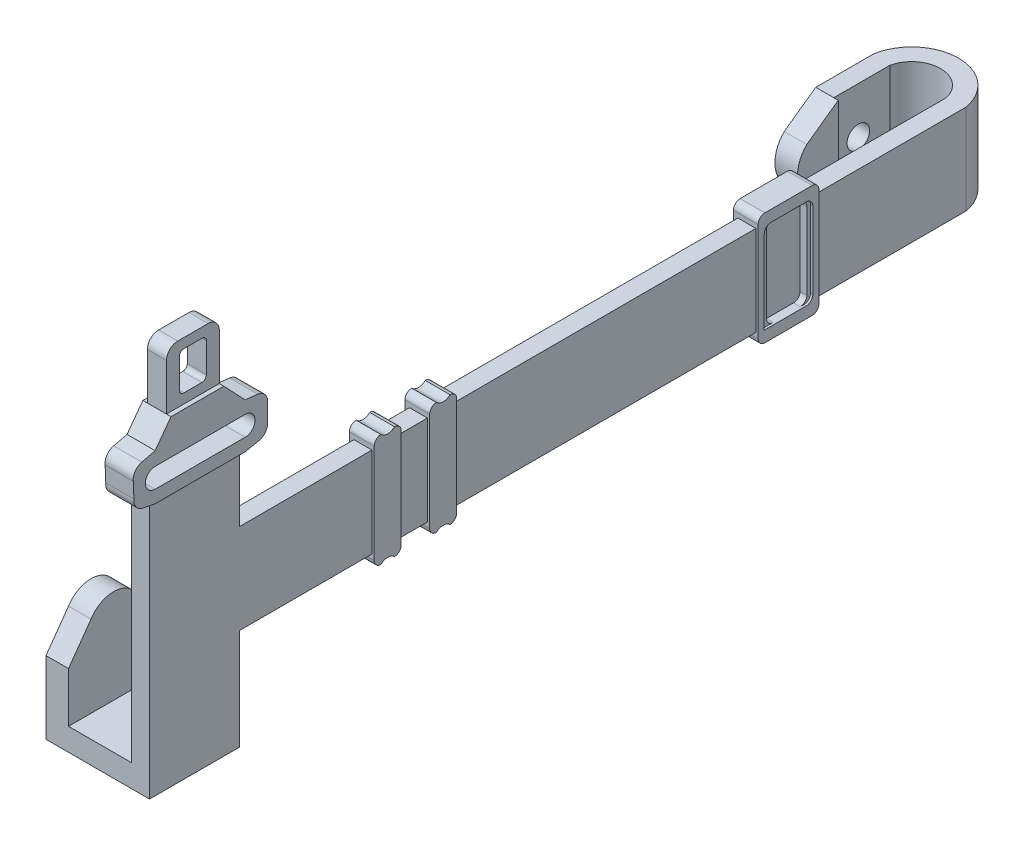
from build123d import *

# Parameters (mm, degrees)
EXTRUIR_L_MINA3_DEPTH         = 40
CROQUIS4_W                    = 8
CROQUIS4_H                    = 40
SALIENTE_EXTRUIR1_DEPTH       = 34.88
SALIENTE_EXTRUIR4_DEPTH       = 1
SALIENTE_EXTRUIR4_DEPTH_BACK  = 10
CORTAR_EXTRUIR1_DEPTH         = 3
CROQUIS16_W                   = 8
CROQUIS16_H                   = 40
SALIENTE_EXTRUIR10_DEPTH      = 30
CROQUIS19_R                   = 5
CORTAR_EXTRUIR4_DEPTH         = 10
SALIENTE_EXTRUIR11_DEPTH      = 10
SALIENTE_EXTRUIR18_DEPTH      = 2.5
SALIENTE_EXTRUIR18_DEPTH_BACK = 10
CORTAR_EXTRUIR5_START         = -2
CORTAR_EXTRUIR5_DEPTH         = 2
CORTAR_EXTRUIR6_DEPTH         = 2
CROQUIS34_W                   = 36
CROQUIS34_H                   = 40
SALIENTE_EXTRUIR19_DEPTH      = 10
CROQUIS35_W                   = 40
CROQUIS35_H                   = 32.24007553
SALIENTE_EXTRUIR20_DEPTH      = 10
SALIENTE_EXTRUIR21_DEPTH      = 10


with BuildPart() as part:
    # Croquis1 → Extruir-L_mina3 (new body)
    with BuildSketch(Plane(origin=(0, 0, 0), x_dir=(1, 0, 0), z_dir=(0, 1, 0))):
        with BuildLine():
            Line((0, -362), (0, 0))
            ThreePointArc((0, 0), (-12.5, 9.959156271), (-25, 0))
            Line((-25, 0), (-25, -25))
            Line((-25, -25), (-33, -25))
            Line((-33, -25), (-33, 0.794805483))
            ThreePointArc((-33, 0.794805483), (-12.5, 17.959156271), (8, 0.794805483))
            Line((8, 0.794805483), (8, -362))
            Line((8, -362), (0, -362))
        make_face()
    extrude(amount=EXTRUIR_L_MINA3_DEPTH)

    # Croquis4 → Saliente-Extruir1 (add)
    with BuildSketch(Plane.XZ):
        with Locations((4, 342)):
            Rectangle(CROQUIS4_W, CROQUIS4_H)
    extrude(amount=SALIENTE_EXTRUIR1_DEPTH)

    # Croquis9 → Saliente-Extruir4 (add, two sides: drawn at the far end of the back side and taken through both)
    # profile 1 of 3: a face of its own
    with BuildSketch(Plane(origin=(8, 0, 0), x_dir=(0, 0, -1), z_dir=(1, 0, 0)).offset(-SALIENTE_EXTRUIR4_DEPTH_BACK)):
        with BuildLine():
            Line((-68.613513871, 45), (-89.587003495, 45))
            ThreePointArc((-89.587003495, 45), (-91.708323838, 44.121320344), (-92.587003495, 42))
            Line((-92.587003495, 42), (-92.587003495, -2))
            ThreePointArc((-92.587003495, -2), (-91.708323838, -4.121320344), (-89.587003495, -5))
            Line((-89.587003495, -5), (-68.613513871, -5))
            ThreePointArc((-68.613513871, -5), (-66.492193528, -4.121320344), (-65.613513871, -2))
            Line((-65.613513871, -2), (-65.613513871, 42))
            ThreePointArc((-65.613513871, 42), (-66.492193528, 44.121320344), (-68.613513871, 45))
        make_face()
        with BuildLine():
            Line((-71.310862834, 40), (-86.889654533, 40))
            ThreePointArc((-86.889654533, 40), (-89.010974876, 39.121320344), (-89.889654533, 37))
            Line((-89.889654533, 37), (-89.889654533, 0))
            Line((-89.889654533, 0), (-71.310862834, 0))
            ThreePointArc((-71.310862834, 0), (-69.18954249, 0.878679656), (-68.310862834, 3))
            Line((-68.310862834, 3), (-68.310862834, 37))
            ThreePointArc((-68.310862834, 37), (-69.18954249, 39.121320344), (-71.310862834, 40))
        make_face(mode=Mode.SUBTRACT)
    # profile 2 of 3: a face of its own
    with BuildSketch(Plane(origin=(8, 0, 0), x_dir=(0, 0, -1), z_dir=(1, 0, 0)).offset(-SALIENTE_EXTRUIR4_DEPTH_BACK)):
        with BuildLine():
            Line((-238.526073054, 42), (-238.526073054, -2))
            ThreePointArc((-238.526073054, -2), (-237.647393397, -4.121320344), (-235.526073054, -5))
            ThreePointArc((-235.526073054, -5), (-232.526073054, -3.757359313), (-229.526073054, -5))
            ThreePointArc((-229.526073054, -5), (-227.40475271, -4.121320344), (-226.526073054, -2))
            Line((-226.526073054, -2), (-226.526073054, 42))
            ThreePointArc((-226.526073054, 42), (-227.40475271, 44.121320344), (-229.526073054, 45))
            ThreePointArc((-229.526073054, 45), (-232.526073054, 43.757359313), (-235.526073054, 45))
            ThreePointArc((-235.526073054, 45), (-237.647393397, 44.121320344), (-238.526073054, 42))
        make_face()
    # profile 3 of 3: a face of its own
    with BuildSketch(Plane(origin=(8, 0, 0), x_dir=(0, 0, -1), z_dir=(1, 0, 0)).offset(-SALIENTE_EXTRUIR4_DEPTH_BACK)):
        with BuildLine():
            Line((-251.180473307, 42), (-251.180473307, -2))
            ThreePointArc((-251.180473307, -2), (-252.059152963, -4.121320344), (-254.180473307, -5))
            ThreePointArc((-254.180473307, -5), (-257.180473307, -3.757359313), (-260.180473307, -5))
            ThreePointArc((-260.180473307, -5), (-262.30179365, -4.121320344), (-263.180473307, -2))
            Line((-263.180473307, -2), (-263.180473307, 42))
            ThreePointArc((-263.180473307, 42), (-262.30179365, 44.121320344), (-260.180473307, 45))
            ThreePointArc((-260.180473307, 45), (-257.180473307, 43.757359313), (-254.180473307, 45))
            ThreePointArc((-254.180473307, 45), (-252.059152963, 44.121320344), (-251.180473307, 42))
        make_face()
    extrude(amount=SALIENTE_EXTRUIR4_DEPTH + SALIENTE_EXTRUIR4_DEPTH_BACK)

    # Croquis10 → Cortar-Extruir1 (cut)
    with BuildSketch(Plane(origin=(8, 0, 0), x_dir=(0, 0, -1), z_dir=(1, 0, 0))):
        with BuildLine():
            Line((-72.919704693, 40), (-84.919704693, 40))
            ThreePointArc((-84.919704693, 40), (-87.041025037, 39.121320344), (-87.919704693, 37))
            Line((-87.919704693, 37), (-87.919704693, 3))
            ThreePointArc((-87.919704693, 3), (-87.041025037, 0.878679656), (-84.919704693, 0))
            Line((-84.919704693, 0), (-72.919704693, 0))
            ThreePointArc((-72.919704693, 0), (-70.79838435, 0.878679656), (-69.919704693, 3))
            Line((-69.919704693, 3), (-69.919704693, 37))
            ThreePointArc((-69.919704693, 37), (-70.79838435, 39.121320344), (-72.919704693, 40))
        make_face()
    extrude(amount=-CORTAR_EXTRUIR1_DEPTH, mode=Mode.SUBTRACT)

    # Croquis16 → Saliente-Extruir10 (add)
    with BuildSketch(Plane(origin=(0, 40, 0), x_dir=(1, 0, 0), z_dir=(0, 1, 0))):
        with Locations((4, -342)):
            Rectangle(CROQUIS16_W, CROQUIS16_H)
    extrude(amount=SALIENTE_EXTRUIR10_DEPTH)

    # Croquis19 → Cortar-Extruir4 (cut)
    with BuildSketch(Plane.ZY.offset(33)):
        with Locations((14.095479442, 19.403681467)):
            Circle(CROQUIS19_R)
    extrude(amount=-CORTAR_EXTRUIR4_DEPTH, mode=Mode.SUBTRACT)

    # Croquis20 → Saliente-Extruir11 (add)
    with BuildSketch(Plane.ZY.offset(33)):
        with BuildLine():
            Line((39, 30), (25, 40))
            Line((25, 40), (25, 0))
            Line((25, 0), (39, 10))
            ThreePointArc((39, 10), (43.142135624, 20), (39, 30))
        make_face()
    extrude(amount=-SALIENTE_EXTRUIR11_DEPTH)

    # Croquis29 → Saliente-Extruir18 (add, two sides: drawn at the far end of the back side and taken through both)
    # profile 1 of 3: a face of its own
    with BuildSketch(Plane(origin=(8, 0, 0), x_dir=(0, 0, -1), z_dir=(1, 0, 0)).offset(-SALIENTE_EXTRUIR18_DEPTH_BACK)):
        with BuildLine():
            ThreePointArc((-362, 90.444555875), (-341.983088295, 91.74394988), (-322, 90))
            Line((-322, 90), (-316.437840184, 89.370644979))
            ThreePointArc((-316.437840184, 89.370644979), (-313.271005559, 87.733203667), (-312, 84.402347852))
            Line((-312, 84.402347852), (-312, 76.099019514))
            ThreePointArc((-312, 76.099019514), (-313.133289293, 72.929074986), (-316.019419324, 71.196116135))
            Line((-316.019419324, 71.196116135), (-322, 70))
            Line((-322, 70), (-362, 70))
            Line((-362, 70), (-367.980580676, 71.196116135))
            ThreePointArc((-367.980580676, 71.196116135), (-370.657820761, 73.230015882), (-371.441718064, 76.499552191))
            Line((-371.441718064, 76.499552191), (-371.726137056, 83.500447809))
            ThreePointArc((-371.726137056, 83.500447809), (-370.883077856, 86.98246349), (-367.927097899, 89.006658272))
            Line((-367.927097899, 89.006658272), (-362, 90.444555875))
        make_face()
        with BuildLine():
            ThreePointArc((-322, 75.608659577), (-317.608659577, 80), (-322, 84.391340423))
            Line((-322, 84.391340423), (-362, 84.391340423))
            ThreePointArc((-362, 84.391340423), (-366.391340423, 80), (-362, 75.608659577))
            Line((-362, 75.608659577), (-322, 75.608659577))
        make_face(mode=Mode.SUBTRACT)
    # profile 2 of 3: a face of its own
    with BuildSketch(Plane(origin=(8, 0, 0), x_dir=(0, 0, -1), z_dir=(1, 0, 0)).offset(-SALIENTE_EXTRUIR18_DEPTH_BACK)):
        with BuildLine():
            Line((-362, 90.444555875), (-354.964473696, 100))
            Line((-354.964473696, 100), (-331.504408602, 100))
            Line((-331.504408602, 100), (-322, 90))
            ThreePointArc((-322, 90), (-341.983088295, 91.74394988), (-362, 90.444555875))
        make_face()
    # profile 3 of 3: a face of its own
    with BuildSketch(Plane(origin=(8, 0, 0), x_dir=(0, 0, -1), z_dir=(1, 0, 0)).offset(-SALIENTE_EXTRUIR18_DEPTH_BACK)):
        with BuildLine():
            Line((-349.964473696, 125.597164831), (-336.504408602, 125.597164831))
            ThreePointArc((-336.504408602, 125.597164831), (-332.968874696, 124.132698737), (-331.504408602, 120.597164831))
            Line((-331.504408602, 120.597164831), (-331.504408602, 100))
            Line((-331.504408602, 100), (-354.964473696, 100))
            Line((-354.964473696, 100), (-354.964473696, 120.597164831))
            ThreePointArc((-354.964473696, 120.597164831), (-353.500007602, 124.132698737), (-349.964473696, 125.597164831))
        make_face()
        with BuildLine():
            Line((-349.234441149, 119.298582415), (-349.234441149, 106.298582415))
            ThreePointArc((-349.234441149, 106.298582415), (-348.648654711, 104.884368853), (-347.234441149, 104.298582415))
            Line((-347.234441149, 104.298582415), (-339.234441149, 104.298582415))
            ThreePointArc((-339.234441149, 104.298582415), (-337.820227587, 104.884368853), (-337.234441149, 106.298582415))
            Line((-337.234441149, 106.298582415), (-337.234441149, 119.298582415))
            ThreePointArc((-337.234441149, 119.298582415), (-337.820227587, 120.712795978), (-339.234441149, 121.298582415))
            Line((-339.234441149, 121.298582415), (-347.234441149, 121.298582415))
            ThreePointArc((-347.234441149, 121.298582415), (-348.648654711, 120.712795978), (-349.234441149, 119.298582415))
        make_face(mode=Mode.SUBTRACT)
    extrude(amount=SALIENTE_EXTRUIR18_DEPTH + SALIENTE_EXTRUIR18_DEPTH_BACK)

    # Croquis30 → Cortar-Extruir5 (cut)
    with BuildSketch(Plane(origin=(10.5, 0, 0), x_dir=(0, 0, -1), z_dir=(1, 0, 0)).offset(CORTAR_EXTRUIR5_START)):
        with BuildLine():
            Line((-354.964473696, 100), (-331.504408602, 100))
            Line((-331.504408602, 100), (-331.504408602, 120.597164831))
            ThreePointArc((-331.504408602, 120.597164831), (-332.968874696, 124.132698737), (-336.504408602, 125.597164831))
            Line((-336.504408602, 125.597164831), (-349.964473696, 125.597164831))
            ThreePointArc((-349.964473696, 125.597164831), (-353.500007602, 124.132698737), (-354.964473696, 120.597164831))
            Line((-354.964473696, 120.597164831), (-354.964473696, 100))
        make_face()
    extrude(amount=CORTAR_EXTRUIR5_DEPTH, mode=Mode.SUBTRACT)

    # Croquis33 → Cortar-Extruir6 (cut)
    with BuildSketch(Plane.ZY.offset(2)):
        with BuildLine():
            Line((331.504408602, 100), (331.504408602, 120.597164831))
            ThreePointArc((331.504408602, 120.597164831), (332.968874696, 124.132698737), (336.504408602, 125.597164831))
            Line((336.504408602, 125.597164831), (349.964473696, 125.597164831))
            ThreePointArc((349.964473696, 125.597164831), (353.500007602, 124.132698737), (354.964473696, 120.597164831))
            Line((354.964473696, 120.597164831), (354.964473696, 100))
            Line((354.964473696, 100), (331.504408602, 100))
        make_face()
    extrude(amount=-CORTAR_EXTRUIR6_DEPTH, mode=Mode.SUBTRACT)

    # Croquis34 → Saliente-Extruir19 (add)
    with BuildSketch(Plane.XZ.offset(34.88)):
        with Locations((-10, 342)):
            Rectangle(CROQUIS34_W, CROQUIS34_H)
    extrude(amount=SALIENTE_EXTRUIR19_DEPTH)

    # Croquis35 → Saliente-Extruir20 (add)
    with BuildSketch(Plane.ZY.offset(28)):
        with Locations((342, -28.759962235)):
            Rectangle(CROQUIS35_W, CROQUIS35_H)
    extrude(amount=SALIENTE_EXTRUIR20_DEPTH)

    # Croquis38 → Saliente-Extruir21 (add)
    with BuildSketch(Plane.ZY.offset(38)):
        with BuildLine():
            Line((322, -12.63992447), (332, 1.36007553))
            ThreePointArc((332, 1.36007553), (342, 6.933300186), (352, 1.36007553))
            Line((352, 1.36007553), (362, -12.63992447))
            Line((362, -12.63992447), (362, -44.88))
            Line((362, -44.88), (322, -44.88))
            Line((322, -44.88), (322, -12.63992447))
        make_face()
    extrude(amount=-SALIENTE_EXTRUIR21_DEPTH)


solid = part.part
